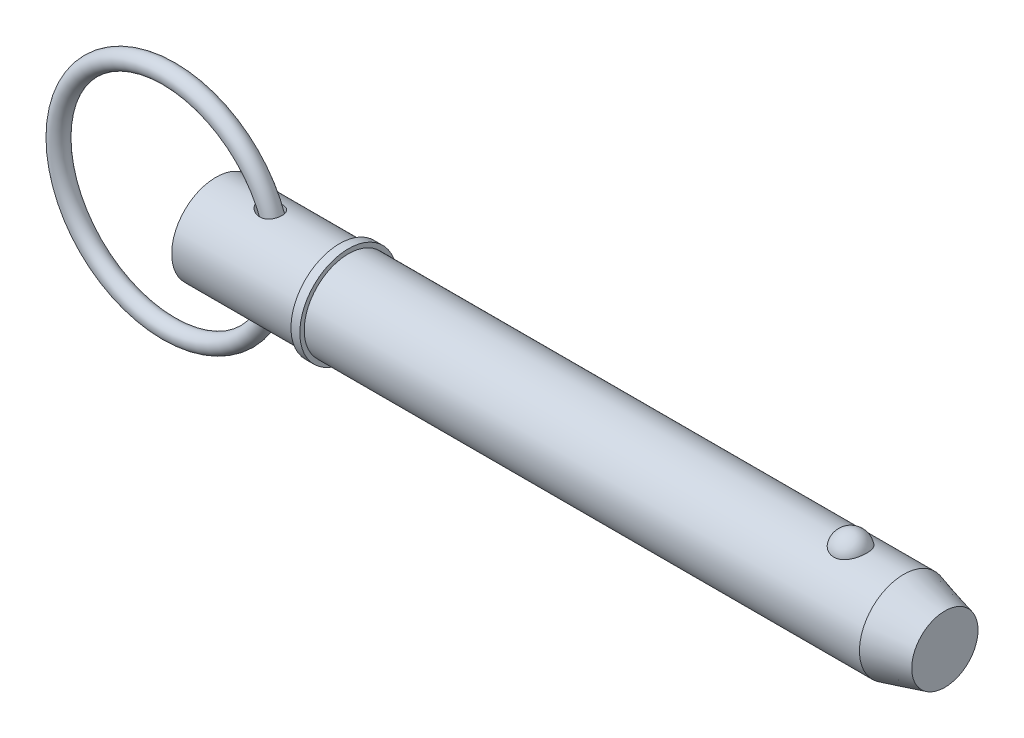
ISO-10303-21;
HEADER;
FILE_DESCRIPTION(('STEP AP214'),'2;1');
FILE_NAME('part.step','',(''),(''),'','','');
FILE_SCHEMA(('AUTOMOTIVE_DESIGN { 1 0 10303 214 1 1 1 1 }'));
ENDSEC;
DATA;
#1=APPLICATION_CONTEXT('core data for automotive mechanical design processes');
#2=APPLICATION_PROTOCOL_DEFINITION('international standard','automotive_design',2000,#1);
#3=PRODUCT_CONTEXT('',#1,'mechanical');
#4=PRODUCT('Part','Part','',(#3));
#5=PRODUCT_RELATED_PRODUCT_CATEGORY('part','',(#4));
#6=PRODUCT_DEFINITION_FORMATION('','',#4);
#7=PRODUCT_DEFINITION_CONTEXT('part definition',#1,'design');
#8=PRODUCT_DEFINITION('design','',#6,#7);
#9=PRODUCT_DEFINITION_SHAPE('','',#8);
#10=(LENGTH_UNIT() NAMED_UNIT(*) SI_UNIT(.MILLI.,.METRE.));
#11=(NAMED_UNIT(*) PLANE_ANGLE_UNIT() SI_UNIT($,.RADIAN.));
#12=(NAMED_UNIT(*) SI_UNIT($,.STERADIAN.) SOLID_ANGLE_UNIT());
#13=UNCERTAINTY_MEASURE_WITH_UNIT(LENGTH_MEASURE(1.E-05),#10,'distance_accuracy_value','');
#14=(GEOMETRIC_REPRESENTATION_CONTEXT(3) GLOBAL_UNCERTAINTY_ASSIGNED_CONTEXT((#13)) GLOBAL_UNIT_ASSIGNED_CONTEXT((#10,
#11,#12)) REPRESENTATION_CONTEXT('',''));
#15=CARTESIAN_POINT('',(0.,0.,0.));
#16=DIRECTION('',(0.,0.,1.));
#17=DIRECTION('',(1.,0.,0.));
#18=AXIS2_PLACEMENT_3D('',#15,#16,#17);
#19=CARTESIAN_POINT('',(-13.4840686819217,0.,0.));
#20=DIRECTION('',(0.,0.,1.));
#21=DIRECTION('',(1.,0.,0.));
#22=AXIS2_PLACEMENT_3D('',#19,#20,#21);
#23=TOROIDAL_SURFACE('',#22,31.75,2.54);
#24=CARTESIAN_POINT('',(20.8059313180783,0.,0.));
#25=VERTEX_POINT('',#24);
#26=VERTEX_LOOP('',#25);
#27=FACE_BOUND('',#26,.T.);
#28=ADVANCED_FACE('P0_F12',(#27),#23,.T.);
#29=CLOSED_SHELL('',(#28));
#30=MANIFOLD_SOLID_BREP('P0_B1',#29);
#31=CARTESIAN_POINT('',(0.,0.,0.));
#32=DIRECTION('',(1.,0.,0.));
#33=DIRECTION('',(0.,0.,-1.));
#34=AXIS2_PLACEMENT_3D('',#31,#32,#33);
#35=CYLINDRICAL_SURFACE('',#34,12.7);
#36=CARTESIAN_POINT('',(13.092900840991,12.5230976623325,-2.11234992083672));
#37=CARTESIAN_POINT('',(13.2535855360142,12.4976398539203,-2.26328363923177));
#38=CARTESIAN_POINT('',(13.4280602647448,12.4718592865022,-2.3995578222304));
#39=CARTESIAN_POINT('',(13.7976341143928,12.4229301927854,-2.64122157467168));
#40=CARTESIAN_POINT('',(13.9927568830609,12.3997847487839,-2.74657519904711));
#41=CARTESIAN_POINT('',(14.397672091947,12.3590534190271,-2.92439761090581));
#42=CARTESIAN_POINT('',(14.6074445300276,12.3414601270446,-2.99691026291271));
#43=CARTESIAN_POINT('',(15.0366557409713,12.3142893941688,-3.10669649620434));
#44=CARTESIAN_POINT('',(15.2560902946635,12.3047084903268,-3.14398530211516));
#45=CARTESIAN_POINT('',(15.5877843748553,12.2976819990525,-3.17128282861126));
#46=CARTESIAN_POINT('',(15.6989364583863,12.2965677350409,-3.17559470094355));
#47=CARTESIAN_POINT('',(15.9211629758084,12.2969101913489,-3.17427486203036));
#48=CARTESIAN_POINT('',(16.0322374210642,12.2983656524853,-3.16864802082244));
#49=CARTESIAN_POINT('',(16.2532861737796,12.3038832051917,-3.14715368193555));
#50=CARTESIAN_POINT('',(16.363260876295,12.3079443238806,-3.13129000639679));
#51=CARTESIAN_POINT('',(16.5810669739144,12.3185954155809,-3.08912320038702));
#52=CARTESIAN_POINT('',(16.6888986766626,12.3251850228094,-3.06282157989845));
#53=CARTESIAN_POINT('',(16.8894247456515,12.3398294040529,-3.00323791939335));
#54=CARTESIAN_POINT('',(16.9824664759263,12.3476389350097,-2.97106098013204));
#55=CARTESIAN_POINT('',(17.1651267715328,12.3648759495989,-2.89848824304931));
#56=CARTESIAN_POINT('',(17.2547457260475,12.3743032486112,-2.85809338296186));
#57=CARTESIAN_POINT('',(17.4297224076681,12.3944822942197,-2.76927391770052));
#58=CARTESIAN_POINT('',(17.5150817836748,12.40523352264,-2.72085245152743));
#59=CARTESIAN_POINT('',(17.6807665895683,12.4277046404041,-2.61629867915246));
#60=CARTESIAN_POINT('',(17.7610923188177,12.4394244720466,-2.56016683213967));
#61=CARTESIAN_POINT('',(17.9797287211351,12.4733252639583,-2.39133767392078));
#62=CARTESIAN_POINT('',(18.1114611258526,12.4961902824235,-2.27005507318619));
#63=CARTESIAN_POINT('',(18.3518677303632,12.5412050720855,-2.00648954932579));
#64=CARTESIAN_POINT('',(18.4605454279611,12.5633549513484,-1.86420981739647));
#65=CARTESIAN_POINT('',(18.6498843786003,12.6039384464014,-1.56614816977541));
#66=CARTESIAN_POINT('',(18.7311185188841,12.622444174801,-1.41073996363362));
#67=CARTESIAN_POINT('',(18.8669149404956,12.6543302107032,-1.08819514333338));
#68=CARTESIAN_POINT('',(18.921477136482,12.6677105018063,-0.921058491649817));
#69=CARTESIAN_POINT('',(19.0028875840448,12.6879542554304,-0.579029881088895));
#70=CARTESIAN_POINT('',(19.0296164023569,12.6947896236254,-0.404107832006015));
#71=CARTESIAN_POINT('',(19.0543673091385,12.7011128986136,-0.0521104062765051));
#72=CARTESIAN_POINT('',(19.0523885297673,12.7006005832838,0.124965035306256));
#73=CARTESIAN_POINT('',(19.019700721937,12.692266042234,0.476969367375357));
#74=CARTESIAN_POINT('',(18.9888798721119,12.6844153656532,0.651887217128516));
#75=CARTESIAN_POINT('',(18.8990221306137,12.6622099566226,0.99389064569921));
#76=CARTESIAN_POINT('',(18.839985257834,12.6478552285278,1.16097622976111));
#77=CARTESIAN_POINT('',(18.6951419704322,12.6142309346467,1.48231767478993));
#78=CARTESIAN_POINT('',(18.6093706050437,12.5949678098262,1.63659000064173));
#79=CARTESIAN_POINT('',(18.4131352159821,12.5536490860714,1.92810749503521));
#80=CARTESIAN_POINT('',(18.3026732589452,12.5315937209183,2.06535408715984));
#81=CARTESIAN_POINT('',(18.060669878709,12.4872833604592,2.31822774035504));
#82=CARTESIAN_POINT('',(17.9292520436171,12.4650302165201,2.43397343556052));
#83=CARTESIAN_POINT('',(17.6485957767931,12.4226514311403,2.64178289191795));
#84=CARTESIAN_POINT('',(17.4993587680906,12.4025256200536,2.73384854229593));
#85=CARTESIAN_POINT('',(17.1869531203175,12.3664726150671,2.8925825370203));
#86=CARTESIAN_POINT('',(17.0237450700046,12.3505578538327,2.95917592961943));
#87=CARTESIAN_POINT('',(16.6884731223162,12.3245177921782,3.06582547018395));
#88=CARTESIAN_POINT('',(16.516407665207,12.3143935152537,3.10587692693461));
#89=CARTESIAN_POINT('',(16.1604213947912,12.3003788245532,3.16093927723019));
#90=CARTESIAN_POINT('',(15.9763106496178,12.2967791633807,3.17478342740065));
#91=CARTESIAN_POINT('',(15.6080973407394,12.2966663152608,3.17521180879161));
#92=CARTESIAN_POINT('',(15.4239948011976,12.3001555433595,3.16178674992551));
#93=CARTESIAN_POINT('',(15.0417156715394,12.3141744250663,3.10676725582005));
#94=CARTESIAN_POINT('',(14.8439465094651,12.3253658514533,3.06251977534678));
#95=CARTESIAN_POINT('',(14.4574652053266,12.3538942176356,2.94531863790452));
#96=CARTESIAN_POINT('',(14.2687614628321,12.3712367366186,2.87233891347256));
#97=CARTESIAN_POINT('',(13.8856104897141,12.4121323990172,2.69045747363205));
#98=CARTESIAN_POINT('',(13.6926012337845,12.4361434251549,2.57861276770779));
#99=CARTESIAN_POINT('',(13.328588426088,12.4862632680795,2.32379935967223));
#100=CARTESIAN_POINT('',(13.1575718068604,12.5123708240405,2.18084927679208));
#101=CARTESIAN_POINT('',(12.8776146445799,12.5579467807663,1.89840233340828));
#102=CARTESIAN_POINT('',(12.7631663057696,12.5776642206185,1.76440341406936));
#103=CARTESIAN_POINT('',(12.5574911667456,12.6143643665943,1.47931295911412));
#104=CARTESIAN_POINT('',(12.4662309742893,12.6313509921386,1.32824646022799));
#105=CARTESIAN_POINT('',(12.3240650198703,12.6583901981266,1.03598403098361));
#106=CARTESIAN_POINT('',(12.2691183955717,12.6691064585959,0.896822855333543));
#107=CARTESIAN_POINT('',(12.1828741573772,12.6860954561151,0.611068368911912));
#108=CARTESIAN_POINT('',(12.1515620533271,12.6923709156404,0.464479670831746));
#109=CARTESIAN_POINT('',(12.1147168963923,12.6997676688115,0.167420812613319));
#110=CARTESIAN_POINT('',(12.1092708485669,12.7008715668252,0.0169392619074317));
#111=CARTESIAN_POINT('',(12.1248234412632,12.6977391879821,-0.282592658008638));
#112=CARTESIAN_POINT('',(12.1458245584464,12.6935024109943,-0.431642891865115));
#113=CARTESIAN_POINT('',(12.210908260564,12.6805581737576,-0.716008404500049));
#114=CARTESIAN_POINT('',(12.2537133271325,12.6720986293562,-0.851633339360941));
#115=CARTESIAN_POINT('',(12.3591295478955,12.6516826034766,-1.11460776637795));
#116=CARTESIAN_POINT('',(12.4217455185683,12.6397252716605,-1.24195523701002));
#117=CARTESIAN_POINT('',(12.5735635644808,12.61152213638,-1.50300095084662));
#118=CARTESIAN_POINT('',(12.6652159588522,12.5949150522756,-1.63522875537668));
#119=CARTESIAN_POINT('',(12.8664347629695,12.5599626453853,-1.88501670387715));
#120=CARTESIAN_POINT('',(12.9760196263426,12.541615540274,-2.0025615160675));
#121=CARTESIAN_POINT('',(13.092900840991,12.5230976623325,-2.11234992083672));
#122=B_SPLINE_CURVE_WITH_KNOTS('',3,(#36,#37,#38,#39,#40,#41,#42,#43,#44,#45,#46,#47,#48,#49,
#50,#51,#52,#53,#54,#55,#56,#57,#58,#59,#60,#61,#62,#63,#64,#65,#66,#67,#68,#69,#70,#71,#72,#73,
#74,#75,#76,#77,#78,#79,#80,#81,#82,#83,#84,#85,#86,#87,#88,#89,#90,#91,#92,#93,#94,#95,#96,#97,
#98,#99,#100,#101,#102,#103,#104,#105,#106,#107,#108,#109,#110,#111,#112,#113,#114,#115,#116,
#117,#118,#119,#120,#121),.UNSPECIFIED.,.T.,.F.,(4,2,2,2,2,2,2,2,2,2,2,2,2,2,2,2,2,2,2,2,2,2,2,
2,2,2,2,2,2,2,2,2,2,2,2,2,2,2,2,2,2,2,4),(0.,0.665132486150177,1.33103515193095,
1.99604575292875,2.66076878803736,2.99410229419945,3.32727250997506,3.66031840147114,
3.99331613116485,4.28918991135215,4.58502994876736,4.88075456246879,5.17646157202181,
5.71510826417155,6.2536731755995,6.78017774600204,7.30668400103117,7.83544030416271,
8.36421259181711,8.89504347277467,9.42587399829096,9.95601150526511,10.4861046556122,
11.0131799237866,11.5402131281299,12.0687854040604,12.5974510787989,13.1491450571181,
13.7010270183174,14.3074556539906,14.914435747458,15.5844380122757,16.2540403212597,
16.7839879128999,17.3131679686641,17.7612578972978,18.2090728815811,18.658393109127,
19.1077554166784,19.5333866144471,19.959121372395,20.4424347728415,20.9262486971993),.UNSPECIFIED.);
#123=CARTESIAN_POINT('',(13.092900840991,12.5230976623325,-2.11234992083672));
#124=VERTEX_POINT('',#123);
#125=EDGE_CURVE('P1_E42',#124,#124,#122,.T.);
#126=ORIENTED_EDGE('',*,*,#125,.T.);
#127=EDGE_LOOP('',(#126));
#128=FACE_BOUND('',#127,.T.);
#129=CARTESIAN_POINT('',(0.,0.,0.));
#130=DIRECTION('',(1.,0.,0.));
#131=DIRECTION('',(0.,0.,-1.));
#132=AXIS2_PLACEMENT_3D('',#129,#130,#131);
#133=CIRCLE('',#132,12.7);
#134=CARTESIAN_POINT('',(0.,0.,-12.7));
#135=VERTEX_POINT('',#134);
#136=EDGE_CURVE('P1_E9',#135,#135,#133,.T.);
#137=ORIENTED_EDGE('',*,*,#136,.T.);
#138=EDGE_LOOP('',(#137));
#139=FACE_BOUND('',#138,.T.);
#140=CARTESIAN_POINT('',(35.56,0.,0.));
#141=DIRECTION('',(1.,0.,0.));
#142=DIRECTION('',(0.,0.,-1.));
#143=AXIS2_PLACEMENT_3D('',#140,#141,#142);
#144=CIRCLE('',#143,12.7);
#145=CARTESIAN_POINT('',(35.56,0.,-12.7));
#146=VERTEX_POINT('',#145);
#147=EDGE_CURVE('P1_E25',#146,#146,#144,.T.);
#148=ORIENTED_EDGE('',*,*,#147,.F.);
#149=EDGE_LOOP('',(#148));
#150=FACE_BOUND('',#149,.T.);
#151=CARTESIAN_POINT('',(13.092900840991,-12.5230976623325,-2.11234992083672));
#152=CARTESIAN_POINT('',(12.9659872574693,-12.5432050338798,-1.99314161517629));
#153=CARTESIAN_POINT('',(12.847667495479,-12.5631124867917,-1.86478966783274));
#154=CARTESIAN_POINT('',(12.6324721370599,-12.6007427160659,-1.59069749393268));
#155=CARTESIAN_POINT('',(12.5355833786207,-12.6184668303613,-1.444968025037));
#156=CARTESIAN_POINT('',(12.409907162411,-12.642034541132,-1.21450950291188));
#157=CARTESIAN_POINT('',(12.3711427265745,-12.6494175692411,-1.13527163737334));
#158=CARTESIAN_POINT('',(12.3010994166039,-12.6628962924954,-0.973464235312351));
#159=CARTESIAN_POINT('',(12.2698164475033,-12.6689926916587,-0.890896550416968));
#160=CARTESIAN_POINT('',(12.2153933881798,-12.6796767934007,-0.723090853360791));
#161=CARTESIAN_POINT('',(12.192246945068,-12.6842656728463,-0.637854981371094));
#162=CARTESIAN_POINT('',(12.154603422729,-12.6917620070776,-0.465421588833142));
#163=CARTESIAN_POINT('',(12.1401047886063,-12.69466976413,-0.378224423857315));
#164=CARTESIAN_POINT('',(12.1214471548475,-12.6984180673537,-0.214417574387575));
#165=CARTESIAN_POINT('',(12.1161713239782,-12.699481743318,-0.137938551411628));
#166=CARTESIAN_POINT('',(12.1124989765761,-12.7002217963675,0.0152189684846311));
#167=CARTESIAN_POINT('',(12.1141046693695,-12.6998977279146,0.0918975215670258));
#168=CARTESIAN_POINT('',(12.1241695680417,-12.6978712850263,0.24474645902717));
#169=CARTESIAN_POINT('',(12.132625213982,-12.6961696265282,0.320917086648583));
#170=CARTESIAN_POINT('',(12.1562110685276,-12.6914452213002,0.472185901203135));
#171=CARTESIAN_POINT('',(12.1713438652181,-12.6884219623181,0.547283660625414));
#172=CARTESIAN_POINT('',(12.223731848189,-12.6780227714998,0.759415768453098));
#173=CARTESIAN_POINT('',(12.268839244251,-12.6691353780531,0.894507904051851));
#174=CARTESIAN_POINT('',(12.3786059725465,-12.6479567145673,1.1560647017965));
#175=CARTESIAN_POINT('',(12.4432700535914,-12.6356646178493,1.28252725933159));
#176=CARTESIAN_POINT('',(12.5971341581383,-12.607236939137,1.5381272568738));
#177=CARTESIAN_POINT('',(12.6882234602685,-12.5908303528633,1.66609325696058));
#178=CARTESIAN_POINT('',(12.887209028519,-12.5564642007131,1.90792082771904));
#179=CARTESIAN_POINT('',(12.995115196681,-12.5385037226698,2.02177401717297));
#180=CARTESIAN_POINT('',(13.2471335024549,-12.4987806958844,2.25547266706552));
#181=CARTESIAN_POINT('',(13.3941979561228,-12.4769622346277,2.3721269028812));
#182=CARTESIAN_POINT('',(13.7036983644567,-12.4349587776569,2.58329351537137));
#183=CARTESIAN_POINT('',(13.8661464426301,-12.4147750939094,2.67778822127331));
#184=CARTESIAN_POINT('',(14.2306024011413,-12.3748157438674,2.85722657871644));
#185=CARTESIAN_POINT('',(14.4347220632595,-12.3556533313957,2.93804226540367));
#186=CARTESIAN_POINT('',(14.8540416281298,-12.3245430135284,3.06594877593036));
#187=CARTESIAN_POINT('',(15.0692453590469,-12.3125976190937,3.11302786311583));
#188=CARTESIAN_POINT('',(15.3981213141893,-12.3014943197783,3.15648626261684));
#189=CARTESIAN_POINT('',(15.5100235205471,-12.298940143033,3.16639841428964));
#190=CARTESIAN_POINT('',(15.7342812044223,-12.2963942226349,3.17627668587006));
#191=CARTESIAN_POINT('',(15.8466364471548,-12.2964012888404,3.1762474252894));
#192=CARTESIAN_POINT('',(16.0707903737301,-12.2990694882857,3.16589868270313));
#193=CARTESIAN_POINT('',(16.1825892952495,-12.3017293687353,3.1555840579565));
#194=CARTESIAN_POINT('',(16.4046123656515,-12.3096862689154,3.12440163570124));
#195=CARTESIAN_POINT('',(16.514836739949,-12.314982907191,3.10353536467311));
#196=CARTESIAN_POINT('',(16.7211934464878,-12.3273933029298,3.05384263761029));
#197=CARTESIAN_POINT('',(16.8175961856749,-12.3342598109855,3.0260738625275));
#198=CARTESIAN_POINT('',(17.0073515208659,-12.3498131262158,2.96195947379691));
#199=CARTESIAN_POINT('',(17.100704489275,-12.3584997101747,2.92561491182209));
#200=CARTESIAN_POINT('',(17.2834584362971,-12.3774243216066,2.84448580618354));
#201=CARTESIAN_POINT('',(17.3728610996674,-12.3876616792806,2.79970490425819));
#202=CARTESIAN_POINT('',(17.5469061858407,-12.409352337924,2.701939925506));
#203=CARTESIAN_POINT('',(17.6315489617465,-12.4208055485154,2.64895645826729));
#204=CARTESIAN_POINT('',(17.7872886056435,-12.4433734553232,2.54070972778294));
#205=CARTESIAN_POINT('',(17.8589017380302,-12.4544123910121,2.48617167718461));
#206=CARTESIAN_POINT('',(17.9970802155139,-12.4768404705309,2.37105291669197));
#207=CARTESIAN_POINT('',(18.063643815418,-12.4882297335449,2.31047013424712));
#208=CARTESIAN_POINT('',(18.1911677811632,-12.5110137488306,2.18372894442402));
#209=CARTESIAN_POINT('',(18.2521311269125,-12.5224084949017,2.11757353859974));
#210=CARTESIAN_POINT('',(18.3680676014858,-12.5448751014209,1.98014449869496));
#211=CARTESIAN_POINT('',(18.4230385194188,-12.5559468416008,1.90886899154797));
#212=CARTESIAN_POINT('',(18.5752306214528,-12.5875288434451,1.69257698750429));
#213=CARTESIAN_POINT('',(18.6637018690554,-12.6071482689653,1.54111740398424));
#214=CARTESIAN_POINT('',(18.8143485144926,-12.6417556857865,1.225260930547));
#215=CARTESIAN_POINT('',(18.876524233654,-12.6567437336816,1.06086419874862));
#216=CARTESIAN_POINT('',(18.9733884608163,-12.6805238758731,0.723195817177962));
#217=CARTESIAN_POINT('',(19.0079967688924,-12.6892978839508,0.549899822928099));
#218=CARTESIAN_POINT('',(19.0486500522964,-12.6996362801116,0.199781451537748));
#219=CARTESIAN_POINT('',(19.054694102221,-12.7012004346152,0.0229589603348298));
#220=CARTESIAN_POINT('',(19.0380549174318,-12.6969431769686,-0.330044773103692));
#221=CARTESIAN_POINT('',(19.0152419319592,-12.6910884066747,-0.506219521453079));
#222=CARTESIAN_POINT('',(18.9411599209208,-12.672565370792,-0.852112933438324));
#223=CARTESIAN_POINT('',(18.8898907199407,-12.659897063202,-1.0218315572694));
#224=CARTESIAN_POINT('',(18.7600888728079,-12.6291327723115,-1.34987035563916));
#225=CARTESIAN_POINT('',(18.6815715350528,-12.6110398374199,-1.50819687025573));
#226=CARTESIAN_POINT('',(18.4991526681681,-12.5714188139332,-1.808997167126));
#227=CARTESIAN_POINT('',(18.3952529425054,-12.5498909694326,-1.95147207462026));
#228=CARTESIAN_POINT('',(18.1653806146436,-12.5059234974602,-2.21580059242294));
#229=CARTESIAN_POINT('',(18.0395297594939,-12.4834893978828,-2.33776101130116));
#230=CARTESIAN_POINT('',(17.7688701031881,-12.4400863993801,-2.55870399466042));
#231=CARTESIAN_POINT('',(17.6240631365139,-12.4191173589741,-2.65768878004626));
#232=CARTESIAN_POINT('',(17.3196803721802,-12.380896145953,-2.8304192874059));
#233=CARTESIAN_POINT('',(17.1601036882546,-12.3636441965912,-2.90416349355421));
#234=CARTESIAN_POINT('',(16.8308162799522,-12.3345597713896,-3.02531546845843));
#235=CARTESIAN_POINT('',(16.6611041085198,-12.322728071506,-3.07271946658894));
#236=CARTESIAN_POINT('',(16.3099674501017,-12.3051318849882,-3.14246490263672));
#237=CARTESIAN_POINT('',(16.1283412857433,-12.2996014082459,-3.16384159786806));
#238=CARTESIAN_POINT('',(15.7639014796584,-12.2955807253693,-3.17942379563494));
#239=CARTESIAN_POINT('',(15.5810875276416,-12.2970924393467,-3.17362188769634));
#240=CARTESIAN_POINT('',(15.20154276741,-12.307074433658,-3.13470416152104));
#241=CARTESIAN_POINT('',(15.0050835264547,-12.316173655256,-3.09911848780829));
#242=CARTESIAN_POINT('',(14.6197996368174,-12.3407987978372,-2.99954607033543));
#243=CARTESIAN_POINT('',(14.4309834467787,-12.3563316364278,-2.93552875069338));
#244=CARTESIAN_POINT('',(14.0353751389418,-12.3949378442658,-2.76840280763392));
#245=CARTESIAN_POINT('',(13.8306109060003,-12.4188242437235,-2.66064798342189));
#246=CARTESIAN_POINT('',(13.4432099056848,-12.4696241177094,-2.4113475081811));
#247=CARTESIAN_POINT('',(13.2605568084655,-12.4965353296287,-2.26982702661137));
#248=CARTESIAN_POINT('',(13.092900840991,-12.5230976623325,-2.11234992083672));
#249=B_SPLINE_CURVE_WITH_KNOTS('',3,(#151,#152,#153,#154,#155,#156,#157,#158,#159,#160,#161,
#162,#163,#164,#165,#166,#167,#168,#169,#170,#171,#172,#173,#174,#175,#176,#177,#178,#179,#180,
#181,#182,#183,#184,#185,#186,#187,#188,#189,#190,#191,#192,#193,#194,#195,#196,#197,#198,#199,
#200,#201,#202,#203,#204,#205,#206,#207,#208,#209,#210,#211,#212,#213,#214,#215,#216,#217,#218,
#219,#220,#221,#222,#223,#224,#225,#226,#227,#228,#229,#230,#231,#232,#233,#234,#235,#236,#237,
#238,#239,#240,#241,#242,#243,#244,#245,#246,#247,#248),.UNSPECIFIED.,.T.,.F.,(4,2,2,2,2,2,2,2,
2,2,2,2,2,2,2,2,2,2,2,2,2,2,2,2,2,2,2,2,2,2,2,2,2,2,2,2,2,2,2,2,2,2,2,2,2,2,2,2,4),(0.,
0.525289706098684,1.05025590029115,1.31549608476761,1.58059075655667,1.84547798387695,
2.11031756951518,2.34000998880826,2.56977615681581,2.79942299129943,3.0291589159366,
3.45531787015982,3.8815803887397,4.35362362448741,4.82594586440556,5.39074449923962,
5.95599200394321,6.61421946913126,7.27267581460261,7.60939383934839,7.9459554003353,
8.2823580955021,8.61871213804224,8.91997243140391,9.22119579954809,9.52228943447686,
9.82336070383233,10.0950952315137,10.3669232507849,10.6386057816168,10.9103882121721,
11.4371688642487,11.9639430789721,12.4922442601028,13.0205625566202,13.5512648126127,
14.0819703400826,14.6123781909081,15.1427483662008,15.6702654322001,16.1977314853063,
16.7252292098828,17.2528024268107,17.7993878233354,18.3461222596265,18.9432829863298,
19.541087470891,20.2355241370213,20.9294447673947),.UNSPECIFIED.);
#250=CARTESIAN_POINT('',(13.092900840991,-12.5230976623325,-2.11234992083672));
#251=VERTEX_POINT('',#250);
#252=EDGE_CURVE('P1_E17',#251,#251,#249,.T.);
#253=ORIENTED_EDGE('',*,*,#252,.T.);
#254=EDGE_LOOP('',(#253));
#255=FACE_BOUND('',#254,.T.);
#256=ADVANCED_FACE('P1_F13',(#128,#139,#150,#255),#35,.T.);
#257=CARTESIAN_POINT('',(0.,0.,0.));
#258=DIRECTION('',(1.,0.,0.));
#259=DIRECTION('',(0.,0.,-1.));
#260=AXIS2_PLACEMENT_3D('',#257,#258,#259);
#261=CYLINDRICAL_SURFACE('',#260,12.7);
#262=CARTESIAN_POINT('',(197.700738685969,0.,0.));
#263=DIRECTION('',(1.,0.,0.));
#264=DIRECTION('',(0.,0.,-1.));
#265=AXIS2_PLACEMENT_3D('',#262,#263,#264);
#266=CIRCLE('',#265,12.7);
#267=CARTESIAN_POINT('',(197.700738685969,0.,-12.7));
#268=VERTEX_POINT('',#267);
#269=EDGE_CURVE('P1_E99',#268,#268,#266,.T.);
#270=ORIENTED_EDGE('',*,*,#269,.F.);
#271=EDGE_LOOP('',(#270));
#272=FACE_BOUND('',#271,.T.);
#273=CARTESIAN_POINT('',(38.1,0.,0.));
#274=DIRECTION('',(1.,0.,0.));
#275=DIRECTION('',(0.,0.,-1.));
#276=AXIS2_PLACEMENT_3D('',#273,#274,#275);
#277=CIRCLE('',#276,12.7);
#278=CARTESIAN_POINT('',(38.1,0.,-12.7));
#279=VERTEX_POINT('',#278);
#280=EDGE_CURVE('P1_E96',#279,#279,#277,.T.);
#281=ORIENTED_EDGE('',*,*,#280,.T.);
#282=EDGE_LOOP('',(#281));
#283=FACE_BOUND('',#282,.T.);
#284=CARTESIAN_POINT('',(182.460042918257,11.7500437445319,4.81938502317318));
#285=CARTESIAN_POINT('',(182.335088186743,11.7500430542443,4.81938571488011));
#286=CARTESIAN_POINT('',(182.210144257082,11.7520975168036,4.81438658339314));
#287=CARTESIAN_POINT('',(181.961142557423,11.760253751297,4.79442904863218));
#288=CARTESIAN_POINT('',(181.837085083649,11.7663568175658,4.77946746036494));
#289=CARTESIAN_POINT('',(181.590901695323,11.7824262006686,4.7397141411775));
#290=CARTESIAN_POINT('',(181.468774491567,11.7923898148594,4.71492928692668));
#291=CARTESIAN_POINT('',(181.227187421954,11.8158938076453,4.65571340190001));
#292=CARTESIAN_POINT('',(181.10772859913,11.8294355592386,4.6212786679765));
#293=CARTESIAN_POINT('',(180.872557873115,11.8596812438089,4.54309502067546));
#294=CARTESIAN_POINT('',(180.756839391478,11.8763792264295,4.49936361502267));
#295=CARTESIAN_POINT('',(180.529653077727,11.9124878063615,4.40287235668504));
#296=CARTESIAN_POINT('',(180.418186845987,11.9318994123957,4.35010914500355));
#297=CARTESIAN_POINT('',(180.091278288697,11.9934256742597,4.17881316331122));
#298=CARTESIAN_POINT('',(179.883127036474,12.038858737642,4.04720756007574));
#299=CARTESIAN_POINT('',(179.485850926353,12.1352173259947,3.748564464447));
#300=CARTESIAN_POINT('',(179.297443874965,12.1862630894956,3.58061821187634));
#301=CARTESIAN_POINT('',(178.950521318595,12.2875163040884,3.21600758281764));
#302=CARTESIAN_POINT('',(178.792011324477,12.3377235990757,3.0193379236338));
#303=CARTESIAN_POINT('',(178.50168878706,12.4344923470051,2.592916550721));
#304=CARTESIAN_POINT('',(178.371376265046,12.4807925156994,2.36208286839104));
#305=CARTESIAN_POINT('',(178.149407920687,12.5623454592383,1.88070399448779));
#306=CARTESIAN_POINT('',(178.057755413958,12.5975972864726,1.63015711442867));
#307=CARTESIAN_POINT('',(177.914046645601,12.6538414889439,1.1129886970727));
#308=CARTESIAN_POINT('',(177.862499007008,12.6746503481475,0.846205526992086));
#309=CARTESIAN_POINT('',(177.801977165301,12.699153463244,0.307085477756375));
#310=CARTESIAN_POINT('',(177.793001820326,12.7028481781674,0.034748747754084));
#311=CARTESIAN_POINT('',(177.817731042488,12.6927785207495,-0.506073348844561));
#312=CARTESIAN_POINT('',(177.851189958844,12.6791146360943,-0.774571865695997));
#313=CARTESIAN_POINT('',(177.959687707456,12.635882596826,-1.30170246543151));
#314=CARTESIAN_POINT('',(178.03472729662,12.606314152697,-1.56033436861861));
#315=CARTESIAN_POINT('',(178.22500006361,12.5342328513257,-2.0608389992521));
#316=CARTESIAN_POINT('',(178.340287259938,12.4917026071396,-2.30268867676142));
#317=CARTESIAN_POINT('',(178.608704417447,12.3981123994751,-2.76259600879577));
#318=CARTESIAN_POINT('',(178.761837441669,12.3470517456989,-2.98065173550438));
#319=CARTESIAN_POINT('',(179.103507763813,12.2416045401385,-3.38786328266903));
#320=CARTESIAN_POINT('',(179.292201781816,12.1872040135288,-3.57688418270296));
#321=CARTESIAN_POINT('',(179.700239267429,12.0814086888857,-3.91941073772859));
#322=CARTESIAN_POINT('',(179.919580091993,12.0300136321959,-4.07291945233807));
#323=CARTESIAN_POINT('',(180.378375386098,11.9373542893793,-4.33691289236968));
#324=CARTESIAN_POINT('',(180.617304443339,11.8958982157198,-4.44824125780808));
#325=CARTESIAN_POINT('',(181.11243761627,11.8268116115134,-4.62881985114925));
#326=CARTESIAN_POINT('',(181.368635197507,11.7991758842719,-4.69808589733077));
#327=CARTESIAN_POINT('',(181.877164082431,11.7622209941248,-4.78983181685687));
#328=CARTESIAN_POINT('',(182.129041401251,11.7520502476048,-4.81449025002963));
#329=CARTESIAN_POINT('',(182.633573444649,11.7485796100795,-4.82295735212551));
#330=CARTESIAN_POINT('',(182.886228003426,11.7552763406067,-4.80677420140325));
#331=CARTESIAN_POINT('',(183.376834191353,11.7842584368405,-4.73525430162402));
#332=CARTESIAN_POINT('',(183.614998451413,11.8060486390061,-4.68116061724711));
#333=CARTESIAN_POINT('',(184.078489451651,11.8622750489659,-4.53678133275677));
#334=CARTESIAN_POINT('',(184.303815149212,11.8967122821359,-4.44649279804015));
#335=CARTESIAN_POINT('',(184.740801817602,11.9754603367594,-4.2298761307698));
#336=CARTESIAN_POINT('',(184.952057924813,12.0199699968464,-4.10280539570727));
#337=CARTESIAN_POINT('',(185.350601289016,12.1138028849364,-3.81685409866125));
#338=CARTESIAN_POINT('',(185.537883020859,12.163127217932,-3.65796622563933));
#339=CARTESIAN_POINT('',(185.893350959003,12.2642343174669,-3.30364864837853));
#340=CARTESIAN_POINT('',(186.060111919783,12.3160165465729,-3.10678783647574));
#341=CARTESIAN_POINT('',(186.359579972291,12.4142566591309,-2.68748409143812));
#342=CARTESIAN_POINT('',(186.492280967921,12.4607135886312,-2.4650365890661));
#343=CARTESIAN_POINT('',(186.724691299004,12.5450236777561,-1.9928951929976));
#344=CARTESIAN_POINT('',(186.823215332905,12.5825557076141,-1.74255918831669));
#345=CARTESIAN_POINT('',(186.979227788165,12.6431720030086,-1.22773734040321));
#346=CARTESIAN_POINT('',(187.036715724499,12.6662560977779,-0.963251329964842));
#347=CARTESIAN_POINT('',(187.109544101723,12.6956486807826,-0.4273550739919));
#348=CARTESIAN_POINT('',(187.124837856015,12.7019385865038,-0.155937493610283));
#349=CARTESIAN_POINT('',(187.112779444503,12.6970201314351,0.385928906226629));
#350=CARTESIAN_POINT('',(187.08542805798,12.6858120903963,0.656377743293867));
#351=CARTESIAN_POINT('',(187.013060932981,12.6568455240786,1.05454017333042));
#352=CARTESIAN_POINT('',(186.983796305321,12.6451962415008,1.18577850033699));
#353=CARTESIAN_POINT('',(186.915022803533,12.6181819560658,1.4451380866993));
#354=CARTESIAN_POINT('',(186.875517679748,12.6028183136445,1.57326046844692));
#355=CARTESIAN_POINT('',(186.786439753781,12.5687547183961,1.82554978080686));
#356=CARTESIAN_POINT('',(186.736862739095,12.5500533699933,1.9497150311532));
#357=CARTESIAN_POINT('',(186.62792115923,12.5098093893,2.19314370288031));
#358=CARTESIAN_POINT('',(186.568560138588,12.4882677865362,2.31240887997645));
#359=CARTESIAN_POINT('',(186.43997128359,12.4427679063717,2.5459303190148));
#360=CARTESIAN_POINT('',(186.370688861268,12.4187964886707,2.66015396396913));
#361=CARTESIAN_POINT('',(186.222903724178,12.3691892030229,2.88202659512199));
#362=CARTESIAN_POINT('',(186.144404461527,12.3435539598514,2.98967802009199));
#363=CARTESIAN_POINT('',(185.978550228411,12.2912955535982,3.1977438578));
#364=CARTESIAN_POINT('',(185.891191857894,12.2646720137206,3.29815546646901));
#365=CARTESIAN_POINT('',(185.708161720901,12.2111945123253,3.49095035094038));
#366=CARTESIAN_POINT('',(185.612493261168,12.1843406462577,3.58333679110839));
#367=CARTESIAN_POINT('',(185.413627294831,12.1312249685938,3.75922876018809));
#368=CARTESIAN_POINT('',(185.310450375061,12.104961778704,3.84275713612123));
#369=CARTESIAN_POINT('',(185.09701336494,12.0537284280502,4.00056406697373));
#370=CARTESIAN_POINT('',(184.986756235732,12.028757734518,4.07484645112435));
#371=CARTESIAN_POINT('',(184.759755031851,11.9808306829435,4.21367959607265));
#372=CARTESIAN_POINT('',(184.643006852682,11.9578756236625,4.27822410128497));
#373=CARTESIAN_POINT('',(184.40394258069,11.9147184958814,4.39698483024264));
#374=CARTESIAN_POINT('',(184.281628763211,11.894515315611,4.45120522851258));
#375=CARTESIAN_POINT('',(184.022952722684,11.8561129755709,4.55255353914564));
#376=CARTESIAN_POINT('',(183.886223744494,11.8381764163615,4.59884858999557));
#377=CARTESIAN_POINT('',(183.608608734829,11.8069093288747,4.67853897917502));
#378=CARTESIAN_POINT('',(183.467724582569,11.7935767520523,4.71194005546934));
#379=CARTESIAN_POINT('',(183.18309446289,11.7720277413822,4.76552188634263));
#380=CARTESIAN_POINT('',(183.039348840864,11.7638106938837,4.78570422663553));
#381=CARTESIAN_POINT('',(182.750411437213,11.7528195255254,4.81263433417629));
#382=CARTESIAN_POINT('',(182.605219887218,11.7500445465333,4.81938421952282));
#383=CARTESIAN_POINT('',(182.460042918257,11.7500437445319,4.81938502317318));
#384=B_SPLINE_CURVE_WITH_KNOTS('',3,(#284,#285,#286,#287,#288,#289,#290,#291,#292,#293,#294,
#295,#296,#297,#298,#299,#300,#301,#302,#303,#304,#305,#306,#307,#308,#309,#310,#311,#312,#313,
#314,#315,#316,#317,#318,#319,#320,#321,#322,#323,#324,#325,#326,#327,#328,#329,#330,#331,#332,
#333,#334,#335,#336,#337,#338,#339,#340,#341,#342,#343,#344,#345,#346,#347,#348,#349,#350,#351,
#352,#353,#354,#355,#356,#357,#358,#359,#360,#361,#362,#363,#364,#365,#366,#367,#368,#369,#370,
#371,#372,#373,#374,#375,#376,#377,#378,#379,#380,#381,#382,#383),.UNSPECIFIED.,.T.,.F.,(4,2,2,
2,2,2,2,2,2,2,2,2,2,2,2,2,2,2,2,2,2,2,2,2,2,2,2,2,2,2,2,2,2,2,2,2,2,2,2,2,2,2,2,2,2,2,2,2,2,4),
(0.,0.374729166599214,0.749578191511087,1.12416526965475,1.49889629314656,1.87292776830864,
2.24709865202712,2.99481328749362,3.76399449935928,4.53331735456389,5.3368391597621,
6.14042986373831,6.95405296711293,7.76765424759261,8.57656703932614,9.38549455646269,
10.1955119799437,11.0055949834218,11.8193353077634,12.6330054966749,13.4294141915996,
14.2255231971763,14.9815786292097,15.7374826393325,16.4696948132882,17.2019663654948,
17.9501979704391,18.6986017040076,19.4844704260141,20.2704797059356,21.0815215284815,
21.8925729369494,22.7045213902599,23.5164550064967,23.9209608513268,24.3253187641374,
24.7298461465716,25.1342272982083,25.54092555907,25.9474719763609,26.3541750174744,
26.7607169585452,27.1661834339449,27.5714814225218,27.9770386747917,28.3824315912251,
28.818120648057,29.2536155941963,29.6890582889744,30.1244323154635),.UNSPECIFIED.);
#385=CARTESIAN_POINT('',(182.460042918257,11.7500437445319,4.81938502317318));
#386=VERTEX_POINT('',#385);
#387=EDGE_CURVE('P1_E34',#386,#386,#384,.T.);
#388=ORIENTED_EDGE('',*,*,#387,.T.);
#389=EDGE_LOOP('',(#388));
#390=FACE_BOUND('',#389,.T.);
#391=ADVANCED_FACE('P1_F46',(#272,#283,#390),#261,.T.);
#392=CARTESIAN_POINT('',(0.,0.,0.));
#393=DIRECTION('',(-1.,0.,0.));
#394=DIRECTION('',(0.,0.,1.));
#395=AXIS2_PLACEMENT_3D('',#392,#393,#394);
#396=PLANE('',#395);
#397=ORIENTED_EDGE('',*,*,#136,.F.);
#398=EDGE_LOOP('',(#397));
#399=FACE_BOUND('',#398,.T.);
#400=ADVANCED_FACE('P1_F15',(#399),#396,.T.);
#401=CARTESIAN_POINT('',(35.56,12.7,0.));
#402=DIRECTION('',(-1.,0.,0.));
#403=DIRECTION('',(0.,0.,1.));
#404=AXIS2_PLACEMENT_3D('',#401,#402,#403);
#405=PLANE('',#404);
#406=ORIENTED_EDGE('',*,*,#147,.T.);
#407=EDGE_LOOP('',(#406));
#408=FACE_BOUND('',#407,.T.);
#409=CARTESIAN_POINT('',(35.56,0.,0.));
#410=DIRECTION('',(1.,0.,0.));
#411=DIRECTION('',(0.,0.,-1.));
#412=AXIS2_PLACEMENT_3D('',#409,#410,#411);
#413=CIRCLE('',#412,13.97);
#414=CARTESIAN_POINT('',(35.56,0.,-13.97));
#415=VERTEX_POINT('',#414);
#416=EDGE_CURVE('P1_E30',#415,#415,#413,.T.);
#417=ORIENTED_EDGE('',*,*,#416,.F.);
#418=EDGE_LOOP('',(#417));
#419=FACE_BOUND('',#418,.T.);
#420=ADVANCED_FACE('P1_F81',(#408,#419),#405,.T.);
#421=CARTESIAN_POINT('',(0.,0.,0.));
#422=DIRECTION('',(1.,0.,0.));
#423=DIRECTION('',(0.,0.,-1.));
#424=AXIS2_PLACEMENT_3D('',#421,#422,#423);
#425=CYLINDRICAL_SURFACE('',#424,13.97);
#426=ORIENTED_EDGE('',*,*,#416,.T.);
#427=EDGE_LOOP('',(#426));
#428=FACE_BOUND('',#427,.T.);
#429=CARTESIAN_POINT('',(38.1,0.,0.));
#430=DIRECTION('',(1.,0.,0.));
#431=DIRECTION('',(0.,0.,-1.));
#432=AXIS2_PLACEMENT_3D('',#429,#430,#431);
#433=CIRCLE('',#432,13.97);
#434=CARTESIAN_POINT('',(38.1,0.,-13.97));
#435=VERTEX_POINT('',#434);
#436=EDGE_CURVE('P1_E95',#435,#435,#433,.T.);
#437=ORIENTED_EDGE('',*,*,#436,.F.);
#438=EDGE_LOOP('',(#437));
#439=FACE_BOUND('',#438,.T.);
#440=ADVANCED_FACE('P1_F68',(#428,#439),#425,.T.);
#441=CARTESIAN_POINT('',(38.1,13.97,0.));
#442=DIRECTION('',(1.,0.,0.));
#443=DIRECTION('',(0.,0.,-1.));
#444=AXIS2_PLACEMENT_3D('',#441,#442,#443);
#445=PLANE('',#444);
#446=ORIENTED_EDGE('',*,*,#436,.T.);
#447=EDGE_LOOP('',(#446));
#448=FACE_BOUND('',#447,.T.);
#449=ORIENTED_EDGE('',*,*,#280,.F.);
#450=EDGE_LOOP('',(#449));
#451=FACE_BOUND('',#450,.T.);
#452=ADVANCED_FACE('P1_F62',(#448,#451),#445,.T.);
#453=CARTESIAN_POINT('',(209.55,0.,0.));
#454=DIRECTION('',(-1.,0.,0.));
#455=DIRECTION('',(0.,0.,1.));
#456=AXIS2_PLACEMENT_3D('',#453,#454,#455);
#457=CONICAL_SURFACE('',#456,9.52500000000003,0.26179938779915);
#458=ORIENTED_EDGE('',*,*,#269,.T.);
#459=EDGE_LOOP('',(#458));
#460=FACE_BOUND('',#459,.T.);
#461=CARTESIAN_POINT('',(209.55,0.,0.));
#462=DIRECTION('',(1.,0.,0.));
#463=DIRECTION('',(0.,0.,-1.));
#464=AXIS2_PLACEMENT_3D('',#461,#462,#463);
#465=CIRCLE('',#464,9.52500000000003);
#466=CARTESIAN_POINT('',(209.55,0.,-9.52500000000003));
#467=VERTEX_POINT('',#466);
#468=EDGE_CURVE('P1_E41',#467,#467,#465,.T.);
#469=ORIENTED_EDGE('',*,*,#468,.F.);
#470=EDGE_LOOP('',(#469));
#471=FACE_BOUND('',#470,.T.);
#472=ADVANCED_FACE('P1_F59',(#460,#471),#457,.T.);
#473=CARTESIAN_POINT('',(209.55,9.52500000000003,0.));
#474=DIRECTION('',(1.,0.,0.));
#475=DIRECTION('',(0.,0.,-1.));
#476=AXIS2_PLACEMENT_3D('',#473,#474,#475);
#477=PLANE('',#476);
#478=ORIENTED_EDGE('',*,*,#468,.T.);
#479=EDGE_LOOP('',(#478));
#480=FACE_BOUND('',#479,.T.);
#481=ADVANCED_FACE('P1_F55',(#480),#477,.T.);
#482=CARTESIAN_POINT('',(182.460042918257,11.43,0.));
#483=DIRECTION('',(-1.,0.,0.));
#484=DIRECTION('',(0.,1.,0.));
#485=AXIS2_PLACEMENT_3D('',#482,#483,#484);
#486=SPHERICAL_SURFACE('',#485,4.83);
#487=ORIENTED_EDGE('',*,*,#387,.F.);
#488=EDGE_LOOP('',(#487));
#489=FACE_BOUND('',#488,.T.);
#490=ADVANCED_FACE('P1_F50',(#489),#486,.T.);
#491=CARTESIAN_POINT('',(-13.4840686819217,0.,0.));
#492=DIRECTION('',(0.,0.,1.));
#493=DIRECTION('',(1.,0.,0.));
#494=AXIS2_PLACEMENT_3D('',#491,#492,#493);
#495=TOROIDAL_SURFACE('',#494,31.75,3.175);
#496=ORIENTED_EDGE('',*,*,#252,.F.);
#497=EDGE_LOOP('',(#496));
#498=FACE_BOUND('',#497,.T.);
#499=ORIENTED_EDGE('',*,*,#125,.F.);
#500=EDGE_LOOP('',(#499));
#501=FACE_BOUND('',#500,.T.);
#502=ADVANCED_FACE('P1_F54',(#498,#501),#495,.F.);
#503=CLOSED_SHELL('',(#256,#391,#400,#420,#440,#452,#472,#481,#490,#502));
#504=MANIFOLD_SOLID_BREP('P1_B1',#503);
#505=ADVANCED_BREP_SHAPE_REPRESENTATION('',(#18,#30,#504),#14);
#506=SHAPE_DEFINITION_REPRESENTATION(#9,#505);
ENDSEC;
END-ISO-10303-21;
